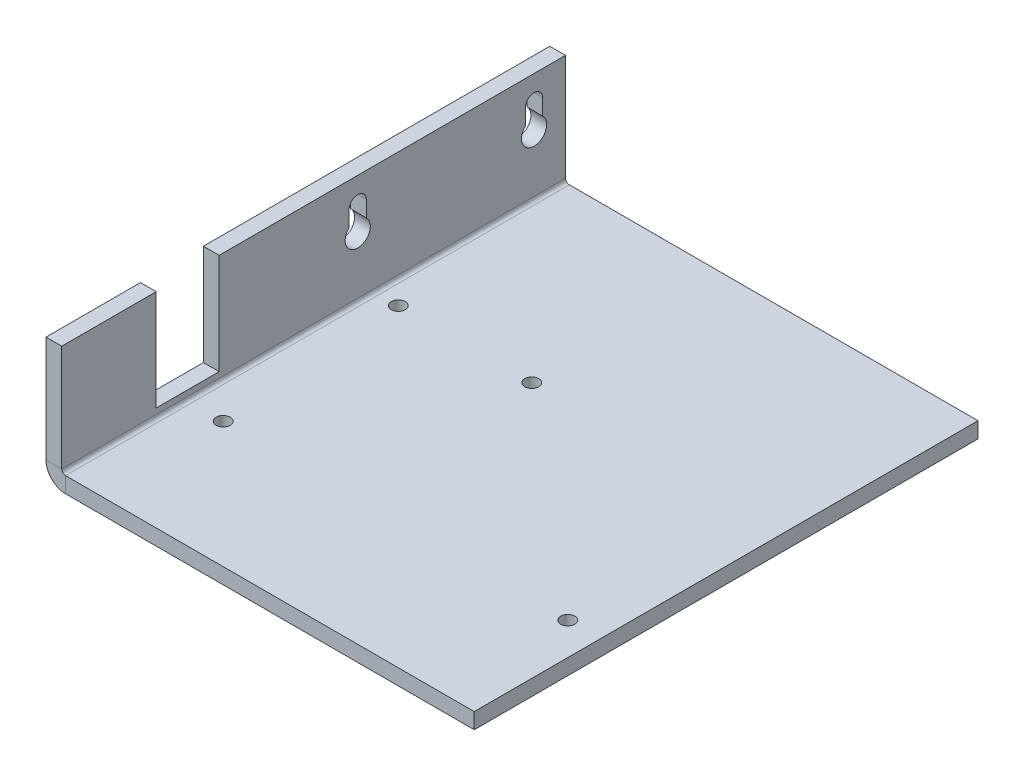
ISO-10303-21;
HEADER;
FILE_DESCRIPTION(('STEP AP214'),'2;1');
FILE_NAME('part.step','',(''),(''),'','','');
FILE_SCHEMA(('AUTOMOTIVE_DESIGN { 1 0 10303 214 1 1 1 1 }'));
ENDSEC;
DATA;
#1=APPLICATION_CONTEXT('core data for automotive mechanical design processes');
#2=APPLICATION_PROTOCOL_DEFINITION('international standard','automotive_design',2000,#1);
#3=PRODUCT_CONTEXT('',#1,'mechanical');
#4=PRODUCT('Part','Part','',(#3));
#5=PRODUCT_RELATED_PRODUCT_CATEGORY('part','',(#4));
#6=PRODUCT_DEFINITION_FORMATION('','',#4);
#7=PRODUCT_DEFINITION_CONTEXT('part definition',#1,'design');
#8=PRODUCT_DEFINITION('design','',#6,#7);
#9=PRODUCT_DEFINITION_SHAPE('','',#8);
#10=(LENGTH_UNIT() NAMED_UNIT(*) SI_UNIT(.MILLI.,.METRE.));
#11=(NAMED_UNIT(*) PLANE_ANGLE_UNIT() SI_UNIT($,.RADIAN.));
#12=(NAMED_UNIT(*) SI_UNIT($,.STERADIAN.) SOLID_ANGLE_UNIT());
#13=UNCERTAINTY_MEASURE_WITH_UNIT(LENGTH_MEASURE(1.E-05),#10,'distance_accuracy_value','');
#14=(GEOMETRIC_REPRESENTATION_CONTEXT(3) GLOBAL_UNCERTAINTY_ASSIGNED_CONTEXT((#13)) GLOBAL_UNIT_ASSIGNED_CONTEXT((#10,
#11,#12)) REPRESENTATION_CONTEXT('',''));
#15=CARTESIAN_POINT('',(0.,0.,0.));
#16=DIRECTION('',(0.,0.,1.));
#17=DIRECTION('',(1.,0.,0.));
#18=AXIS2_PLACEMENT_3D('',#15,#16,#17);
#19=CARTESIAN_POINT('',(167.679572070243,25.4,-101.6));
#20=DIRECTION('',(0.,-1.,0.));
#21=DIRECTION('',(1.,0.,0.));
#22=AXIS2_PLACEMENT_3D('',#19,#20,#21);
#23=PLANE('',#22);
#24=DIRECTION('',(0.,0.,1.));
#25=VECTOR('',#24,1.);
#26=CARTESIAN_POINT('',(-43.18,25.4,-101.6));
#27=LINE('',#26,#25);
#28=CARTESIAN_POINT('',(-43.1799999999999,25.4,-101.6));
#29=VERTEX_POINT('',#28);
#30=CARTESIAN_POINT('',(-43.18,25.4,-31.7500000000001));
#31=VERTEX_POINT('',#30);
#32=EDGE_CURVE('E334',#29,#31,#27,.T.);
#33=ORIENTED_EDGE('',*,*,#32,.T.);
#34=DIRECTION('',(1.,0.,0.));
#35=VECTOR('',#34,1.);
#36=CARTESIAN_POINT('',(167.679572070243,25.4,-31.7500000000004));
#37=LINE('',#36,#35);
#38=CARTESIAN_POINT('',(-40.005,25.4,-31.7500000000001));
#39=VERTEX_POINT('',#38);
#40=EDGE_CURVE('E11',#31,#39,#37,.T.);
#41=ORIENTED_EDGE('',*,*,#40,.T.);
#42=DIRECTION('',(0.,0.,1.));
#43=VECTOR('',#42,1.);
#44=CARTESIAN_POINT('',(-40.005,25.4,-101.6));
#45=LINE('',#44,#43);
#46=CARTESIAN_POINT('',(-40.005,25.4,-101.6));
#47=VERTEX_POINT('',#46);
#48=EDGE_CURVE('E347',#47,#39,#45,.T.);
#49=ORIENTED_EDGE('',*,*,#48,.F.);
#50=DIRECTION('',(-1.,0.,0.));
#51=VECTOR('',#50,1.);
#52=CARTESIAN_POINT('',(167.679572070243,25.4,-101.6));
#53=LINE('',#52,#51);
#54=EDGE_CURVE('E358',#47,#29,#53,.T.);
#55=ORIENTED_EDGE('',*,*,#54,.T.);
#56=EDGE_LOOP('',(#33,#41,#49,#55));
#57=FACE_BOUND('',#56,.T.);
#58=ADVANCED_FACE('F34',(#57),#23,.F.);
#59=CARTESIAN_POINT('',(-40.005,0.,-101.6));
#60=DIRECTION('',(-1.,0.,0.));
#61=DIRECTION('',(0.,0.,1.));
#62=AXIS2_PLACEMENT_3D('',#59,#60,#61);
#63=PLANE('',#62);
#64=ORIENTED_EDGE('',*,*,#48,.T.);
#65=DIRECTION('',(0.,-1.,0.));
#66=VECTOR('',#65,1.);
#67=CARTESIAN_POINT('',(-40.005,0.,-31.7500000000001));
#68=LINE('',#67,#66);
#69=CARTESIAN_POINT('',(-40.005,5.07999999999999,-31.7499999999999));
#70=VERTEX_POINT('',#69);
#71=EDGE_CURVE('E200',#39,#70,#68,.T.);
#72=ORIENTED_EDGE('',*,*,#71,.T.);
#73=DIRECTION('',(0.,0.,1.));
#74=VECTOR('',#73,1.);
#75=CARTESIAN_POINT('',(-40.005,5.08000000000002,-101.6));
#76=LINE('',#75,#74);
#77=CARTESIAN_POINT('',(-40.005,5.08000000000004,-19.05));
#78=VERTEX_POINT('',#77);
#79=EDGE_CURVE('E178',#70,#78,#76,.T.);
#80=ORIENTED_EDGE('',*,*,#79,.T.);
#81=DIRECTION('',(0.,1.,0.));
#82=VECTOR('',#81,1.);
#83=CARTESIAN_POINT('',(-40.005,0.,-19.05));
#84=LINE('',#83,#82);
#85=CARTESIAN_POINT('',(-40.005,25.4,-19.05));
#86=VERTEX_POINT('',#85);
#87=EDGE_CURVE('E196',#78,#86,#84,.T.);
#88=ORIENTED_EDGE('',*,*,#87,.T.);
#89=CARTESIAN_POINT('',(-40.005,25.4,0.));
#90=VERTEX_POINT('',#89);
#91=EDGE_CURVE('E346',#86,#90,#45,.T.);
#92=ORIENTED_EDGE('',*,*,#91,.T.);
#93=DIRECTION('',(0.,1.,0.));
#94=VECTOR('',#93,1.);
#95=CARTESIAN_POINT('',(-40.005,0.,0.));
#96=LINE('',#95,#94);
#97=CARTESIAN_POINT('',(-40.005,3.937,0.));
#98=VERTEX_POINT('',#97);
#99=EDGE_CURVE('E341',#90,#98,#96,.F.);
#100=ORIENTED_EDGE('',*,*,#99,.T.);
#101=DIRECTION('',(0.,0.,-1.));
#102=VECTOR('',#101,1.);
#103=CARTESIAN_POINT('',(-40.005,3.937,-101.6));
#104=LINE('',#103,#102);
#105=CARTESIAN_POINT('',(-40.005,3.93699999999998,-101.6));
#106=VERTEX_POINT('',#105);
#107=EDGE_CURVE('E350',#98,#106,#104,.T.);
#108=ORIENTED_EDGE('',*,*,#107,.T.);
#109=DIRECTION('',(0.,1.,0.));
#110=VECTOR('',#109,1.);
#111=CARTESIAN_POINT('',(-40.005,0.,-101.6));
#112=LINE('',#111,#110);
#113=EDGE_CURVE('E343',#47,#106,#112,.F.);
#114=ORIENTED_EDGE('',*,*,#113,.F.);
#115=EDGE_LOOP('',(#64,#72,#80,#88,#92,#100,#108,#114));
#116=FACE_BOUND('',#115,.T.);
#117=CARTESIAN_POINT('',(-40.005,15.24,-95.2500000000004));
#118=DIRECTION('',(1.,0.,0.));
#119=DIRECTION('',(0.,0.,-1.));
#120=AXIS2_PLACEMENT_3D('',#117,#118,#119);
#121=CIRCLE('',#120,2.54);
#122=CARTESIAN_POINT('',(-40.005,17.1023587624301,-93.5228000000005));
#123=VERTEX_POINT('',#122);
#124=CARTESIAN_POINT('',(-40.005,17.1023587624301,-96.9772000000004));
#125=VERTEX_POINT('',#124);
#126=EDGE_CURVE('E237',#123,#125,#121,.T.);
#127=ORIENTED_EDGE('',*,*,#126,.F.);
#128=DIRECTION('',(0.,-1.,0.));
#129=VECTOR('',#128,1.);
#130=CARTESIAN_POINT('',(-40.005,20.32,-93.5228));
#131=LINE('',#130,#129);
#132=CARTESIAN_POINT('',(-40.005,20.32,-93.5228));
#133=VERTEX_POINT('',#132);
#134=EDGE_CURVE('E235',#133,#123,#131,.T.);
#135=ORIENTED_EDGE('',*,*,#134,.F.);
#136=CARTESIAN_POINT('',(-40.005,20.32,-95.2500000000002));
#137=DIRECTION('',(1.,0.,0.));
#138=DIRECTION('',(0.,0.,-1.));
#139=AXIS2_PLACEMENT_3D('',#136,#137,#138);
#140=CIRCLE('',#139,1.7272);
#141=CARTESIAN_POINT('',(-40.005,20.32,-96.9772000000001));
#142=VERTEX_POINT('',#141);
#143=EDGE_CURVE('E231',#142,#133,#140,.T.);
#144=ORIENTED_EDGE('',*,*,#143,.F.);
#145=DIRECTION('',(0.,1.,0.));
#146=VECTOR('',#145,1.);
#147=CARTESIAN_POINT('',(-40.005,20.32,-96.9772000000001));
#148=LINE('',#147,#146);
#149=EDGE_CURVE('E239',#125,#142,#148,.T.);
#150=ORIENTED_EDGE('',*,*,#149,.F.);
#151=EDGE_LOOP('',(#127,#135,#144,#150));
#152=FACE_BOUND('',#151,.T.);
#153=CARTESIAN_POINT('',(-40.005,20.32,-59.6900000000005));
#154=DIRECTION('',(1.,0.,0.));
#155=DIRECTION('',(0.,0.,1.));
#156=AXIS2_PLACEMENT_3D('',#153,#154,#155);
#157=CIRCLE('',#156,1.7272);
#158=CARTESIAN_POINT('',(-40.005,20.32,-61.4172000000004));
#159=VERTEX_POINT('',#158);
#160=CARTESIAN_POINT('',(-40.005,20.32,-57.9628000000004));
#161=VERTEX_POINT('',#160);
#162=EDGE_CURVE('E207',#159,#161,#157,.T.);
#163=ORIENTED_EDGE('',*,*,#162,.F.);
#164=DIRECTION('',(0.,1.,0.));
#165=VECTOR('',#164,1.);
#166=CARTESIAN_POINT('',(-40.005,20.32,-61.4172000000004));
#167=LINE('',#166,#165);
#168=CARTESIAN_POINT('',(-40.005,17.1023587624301,-61.4172000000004));
#169=VERTEX_POINT('',#168);
#170=EDGE_CURVE('E205',#169,#159,#167,.T.);
#171=ORIENTED_EDGE('',*,*,#170,.F.);
#172=CARTESIAN_POINT('',(-40.005,15.24,-59.6900000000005));
#173=DIRECTION('',(1.,0.,0.));
#174=DIRECTION('',(0.,0.,1.));
#175=AXIS2_PLACEMENT_3D('',#172,#173,#174);
#176=CIRCLE('',#175,2.54);
#177=CARTESIAN_POINT('',(-40.005,17.1023587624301,-57.9628000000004));
#178=VERTEX_POINT('',#177);
#179=EDGE_CURVE('E203',#178,#169,#176,.T.);
#180=ORIENTED_EDGE('',*,*,#179,.F.);
#181=DIRECTION('',(0.,-1.,0.));
#182=VECTOR('',#181,1.);
#183=CARTESIAN_POINT('',(-40.005,20.32,-57.9628000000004));
#184=LINE('',#183,#182);
#185=EDGE_CURVE('E209',#161,#178,#184,.T.);
#186=ORIENTED_EDGE('',*,*,#185,.F.);
#187=EDGE_LOOP('',(#163,#171,#180,#186));
#188=FACE_BOUND('',#187,.T.);
#189=ADVANCED_FACE('F375',(#116,#152,#188),#63,.F.);
#190=CARTESIAN_POINT('',(-43.18,0.,-101.6));
#191=DIRECTION('',(-1.,0.,0.));
#192=DIRECTION('',(0.,0.,1.));
#193=AXIS2_PLACEMENT_3D('',#190,#191,#192);
#194=PLANE('',#193);
#195=DIRECTION('',(0.,-1.,0.));
#196=VECTOR('',#195,1.);
#197=CARTESIAN_POINT('',(-43.18,45.72,-31.7499999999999));
#198=LINE('',#197,#196);
#199=CARTESIAN_POINT('',(-43.18,5.08,-31.7499999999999));
#200=VERTEX_POINT('',#199);
#201=EDGE_CURVE('E184',#31,#200,#198,.T.);
#202=ORIENTED_EDGE('',*,*,#201,.F.);
#203=ORIENTED_EDGE('',*,*,#32,.F.);
#204=DIRECTION('',(0.,-1.,0.));
#205=VECTOR('',#204,1.);
#206=CARTESIAN_POINT('',(-43.18,0.,-101.6));
#207=LINE('',#206,#205);
#208=CARTESIAN_POINT('',(-43.18,3.93700000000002,-101.6));
#209=VERTEX_POINT('',#208);
#210=EDGE_CURVE('E336',#29,#209,#207,.T.);
#211=ORIENTED_EDGE('',*,*,#210,.T.);
#212=DIRECTION('',(0.,0.,-1.));
#213=VECTOR('',#212,1.);
#214=CARTESIAN_POINT('',(-43.18,3.93700000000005,-101.6));
#215=LINE('',#214,#213);
#216=CARTESIAN_POINT('',(-43.18,3.93700000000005,0.));
#217=VERTEX_POINT('',#216);
#218=EDGE_CURVE('E338',#217,#209,#215,.T.);
#219=ORIENTED_EDGE('',*,*,#218,.F.);
#220=DIRECTION('',(0.,-1.,0.));
#221=VECTOR('',#220,1.);
#222=CARTESIAN_POINT('',(-43.18,0.,0.));
#223=LINE('',#222,#221);
#224=CARTESIAN_POINT('',(-43.18,25.4,0.));
#225=VERTEX_POINT('',#224);
#226=EDGE_CURVE('E279',#225,#217,#223,.T.);
#227=ORIENTED_EDGE('',*,*,#226,.F.);
#228=CARTESIAN_POINT('',(-43.18,25.4,-19.05));
#229=VERTEX_POINT('',#228);
#230=EDGE_CURVE('E333',#229,#225,#27,.T.);
#231=ORIENTED_EDGE('',*,*,#230,.F.);
#232=DIRECTION('',(0.,1.,0.));
#233=VECTOR('',#232,1.);
#234=CARTESIAN_POINT('',(-43.18,45.72,-19.05));
#235=LINE('',#234,#233);
#236=CARTESIAN_POINT('',(-43.18,5.07999999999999,-19.05));
#237=VERTEX_POINT('',#236);
#238=EDGE_CURVE('E49',#237,#229,#235,.T.);
#239=ORIENTED_EDGE('',*,*,#238,.F.);
#240=DIRECTION('',(0.,0.,1.));
#241=VECTOR('',#240,1.);
#242=CARTESIAN_POINT('',(-43.18,5.08,-31.7499999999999));
#243=LINE('',#242,#241);
#244=EDGE_CURVE('E176',#200,#237,#243,.T.);
#245=ORIENTED_EDGE('',*,*,#244,.F.);
#246=EDGE_LOOP('',(#202,#203,#211,#219,#227,#231,#239,#245));
#247=FACE_BOUND('',#246,.T.);
#248=DIRECTION('',(0.,1.,0.));
#249=VECTOR('',#248,1.);
#250=CARTESIAN_POINT('',(-43.18,0.,-93.5228));
#251=LINE('',#250,#249);
#252=CARTESIAN_POINT('',(-43.18,20.32,-93.5228));
#253=VERTEX_POINT('',#252);
#254=CARTESIAN_POINT('',(-43.18,17.1023587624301,-93.5228000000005));
#255=VERTEX_POINT('',#254);
#256=EDGE_CURVE('E244',#253,#255,#251,.F.);
#257=ORIENTED_EDGE('',*,*,#256,.T.);
#258=CARTESIAN_POINT('',(-43.18,15.24,-95.2500000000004));
#259=DIRECTION('',(1.,0.,0.));
#260=DIRECTION('',(0.,0.,-1.));
#261=AXIS2_PLACEMENT_3D('',#258,#259,#260);
#262=CIRCLE('',#261,2.54);
#263=CARTESIAN_POINT('',(-43.18,17.1023587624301,-96.9772000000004));
#264=VERTEX_POINT('',#263);
#265=EDGE_CURVE('E249',#255,#264,#262,.T.);
#266=ORIENTED_EDGE('',*,*,#265,.T.);
#267=DIRECTION('',(0.,1.,0.));
#268=VECTOR('',#267,1.);
#269=CARTESIAN_POINT('',(-43.18,0.,-96.9772));
#270=LINE('',#269,#268);
#271=CARTESIAN_POINT('',(-43.18,20.32,-96.9772000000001));
#272=VERTEX_POINT('',#271);
#273=EDGE_CURVE('E245',#264,#272,#270,.T.);
#274=ORIENTED_EDGE('',*,*,#273,.T.);
#275=CARTESIAN_POINT('',(-43.18,20.32,-95.2500000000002));
#276=DIRECTION('',(1.,0.,0.));
#277=DIRECTION('',(0.,0.,-1.));
#278=AXIS2_PLACEMENT_3D('',#275,#276,#277);
#279=CIRCLE('',#278,1.7272);
#280=EDGE_CURVE('E241',#272,#253,#279,.T.);
#281=ORIENTED_EDGE('',*,*,#280,.T.);
#282=EDGE_LOOP('',(#257,#266,#274,#281));
#283=FACE_BOUND('',#282,.T.);
#284=DIRECTION('',(0.,1.,0.));
#285=VECTOR('',#284,1.);
#286=CARTESIAN_POINT('',(-43.18,0.,-61.4172000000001));
#287=LINE('',#286,#285);
#288=CARTESIAN_POINT('',(-43.18,17.1023587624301,-61.4172000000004));
#289=VERTEX_POINT('',#288);
#290=CARTESIAN_POINT('',(-43.18,20.32,-61.4172000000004));
#291=VERTEX_POINT('',#290);
#292=EDGE_CURVE('E214',#289,#291,#287,.T.);
#293=ORIENTED_EDGE('',*,*,#292,.T.);
#294=CARTESIAN_POINT('',(-43.18,20.32,-59.6900000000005));
#295=DIRECTION('',(1.,0.,0.));
#296=DIRECTION('',(0.,0.,-1.));
#297=AXIS2_PLACEMENT_3D('',#294,#295,#296);
#298=CIRCLE('',#297,1.7272);
#299=CARTESIAN_POINT('',(-43.18,20.32,-57.9628000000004));
#300=VERTEX_POINT('',#299);
#301=EDGE_CURVE('E218',#291,#300,#298,.T.);
#302=ORIENTED_EDGE('',*,*,#301,.T.);
#303=DIRECTION('',(0.,1.,0.));
#304=VECTOR('',#303,1.);
#305=CARTESIAN_POINT('',(-43.18,0.,-57.9628000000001));
#306=LINE('',#305,#304);
#307=CARTESIAN_POINT('',(-43.18,17.1023587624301,-57.9628000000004));
#308=VERTEX_POINT('',#307);
#309=EDGE_CURVE('E215',#300,#308,#306,.F.);
#310=ORIENTED_EDGE('',*,*,#309,.T.);
#311=CARTESIAN_POINT('',(-43.18,15.24,-59.6900000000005));
#312=DIRECTION('',(1.,0.,0.));
#313=DIRECTION('',(0.,0.,-1.));
#314=AXIS2_PLACEMENT_3D('',#311,#312,#313);
#315=CIRCLE('',#314,2.54);
#316=EDGE_CURVE('E211',#308,#289,#315,.T.);
#317=ORIENTED_EDGE('',*,*,#316,.T.);
#318=EDGE_LOOP('',(#293,#302,#310,#317));
#319=FACE_BOUND('',#318,.T.);
#320=ADVANCED_FACE('F190',(#247,#283,#319),#194,.T.);
#321=CARTESIAN_POINT('',(167.679572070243,0.,-101.6));
#322=DIRECTION('',(0.,0.,-1.));
#323=DIRECTION('',(0.,1.,0.));
#324=AXIS2_PLACEMENT_3D('',#321,#322,#323);
#325=PLANE('',#324);
#326=DIRECTION('',(-1.,0.,0.));
#327=VECTOR('',#326,1.);
#328=CARTESIAN_POINT('',(167.679572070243,3.93700000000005,-101.6));
#329=LINE('',#328,#327);
#330=EDGE_CURVE('E361',#106,#209,#329,.T.);
#331=ORIENTED_EDGE('',*,*,#330,.T.);
#332=ORIENTED_EDGE('',*,*,#210,.F.);
#333=ORIENTED_EDGE('',*,*,#54,.F.);
#334=ORIENTED_EDGE('',*,*,#113,.T.);
#335=EDGE_LOOP('',(#331,#332,#333,#334));
#336=FACE_BOUND('',#335,.T.);
#337=ADVANCED_FACE('F36',(#336),#325,.T.);
#338=ORIENTED_EDGE('',*,*,#91,.F.);
#339=DIRECTION('',(-1.,0.,0.));
#340=VECTOR('',#339,1.);
#341=CARTESIAN_POINT('',(167.679572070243,25.4,-19.0500000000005));
#342=LINE('',#341,#340);
#343=EDGE_CURVE('E42',#86,#229,#342,.T.);
#344=ORIENTED_EDGE('',*,*,#343,.T.);
#345=ORIENTED_EDGE('',*,*,#230,.T.);
#346=DIRECTION('',(-1.,0.,0.));
#347=VECTOR('',#346,1.);
#348=CARTESIAN_POINT('',(167.679572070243,25.4,-4.44089209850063E-13));
#349=LINE('',#348,#347);
#350=EDGE_CURVE('E355',#90,#225,#349,.T.);
#351=ORIENTED_EDGE('',*,*,#350,.F.);
#352=EDGE_LOOP('',(#338,#344,#345,#351));
#353=FACE_BOUND('',#352,.T.);
#354=ADVANCED_FACE('F365',(#353),#23,.F.);
#355=CARTESIAN_POINT('',(167.679572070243,0.,0.));
#356=DIRECTION('',(0.,0.,-1.));
#357=DIRECTION('',(0.,1.,0.));
#358=AXIS2_PLACEMENT_3D('',#355,#356,#357);
#359=PLANE('',#358);
#360=ORIENTED_EDGE('',*,*,#226,.T.);
#361=DIRECTION('',(-1.,0.,0.));
#362=VECTOR('',#361,1.);
#363=CARTESIAN_POINT('',(167.679572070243,3.93700000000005,0.));
#364=LINE('',#363,#362);
#365=EDGE_CURVE('E352',#98,#217,#364,.T.);
#366=ORIENTED_EDGE('',*,*,#365,.F.);
#367=ORIENTED_EDGE('',*,*,#99,.F.);
#368=ORIENTED_EDGE('',*,*,#350,.T.);
#369=EDGE_LOOP('',(#360,#366,#367,#368));
#370=FACE_BOUND('',#369,.T.);
#371=ADVANCED_FACE('F371',(#370),#359,.F.);
#372=CARTESIAN_POINT('',(43.18,264.832110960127,-101.6));
#373=DIRECTION('',(1.,0.,0.));
#374=DIRECTION('',(0.,0.,-1.));
#375=AXIS2_PLACEMENT_3D('',#372,#373,#374);
#376=PLANE('',#375);
#377=DIRECTION('',(0.,-1.,0.));
#378=VECTOR('',#377,1.);
#379=CARTESIAN_POINT('',(43.18,264.832110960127,0.));
#380=LINE('',#379,#378);
#381=CARTESIAN_POINT('',(43.18,3.17499999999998,0.));
#382=VERTEX_POINT('',#381);
#383=CARTESIAN_POINT('',(43.18,0.,0.));
#384=VERTEX_POINT('',#383);
#385=EDGE_CURVE('E325',#382,#384,#380,.T.);
#386=ORIENTED_EDGE('',*,*,#385,.T.);
#387=DIRECTION('',(0.,0.,1.));
#388=VECTOR('',#387,1.);
#389=CARTESIAN_POINT('',(43.18,0.,-101.6));
#390=LINE('',#389,#388);
#391=CARTESIAN_POINT('',(43.18,0.,-101.6));
#392=VERTEX_POINT('',#391);
#393=EDGE_CURVE('E283',#392,#384,#390,.T.);
#394=ORIENTED_EDGE('',*,*,#393,.F.);
#395=DIRECTION('',(0.,-1.,0.));
#396=VECTOR('',#395,1.);
#397=CARTESIAN_POINT('',(43.18,264.832110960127,-101.6));
#398=LINE('',#397,#396);
#399=CARTESIAN_POINT('',(43.18,3.17500000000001,-101.6));
#400=VERTEX_POINT('',#399);
#401=EDGE_CURVE('E280',#400,#392,#398,.T.);
#402=ORIENTED_EDGE('',*,*,#401,.F.);
#403=DIRECTION('',(0.,0.,1.));
#404=VECTOR('',#403,1.);
#405=CARTESIAN_POINT('',(43.18,3.17500000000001,-101.6));
#406=LINE('',#405,#404);
#407=EDGE_CURVE('E323',#400,#382,#406,.T.);
#408=ORIENTED_EDGE('',*,*,#407,.T.);
#409=EDGE_LOOP('',(#386,#394,#402,#408));
#410=FACE_BOUND('',#409,.T.);
#411=ADVANCED_FACE('F397',(#410),#376,.T.);
#412=CARTESIAN_POINT('',(36.6522,3.17500000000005,-25.4));
#413=DIRECTION('',(0.,1.,0.));
#414=DIRECTION('',(0.,0.,1.));
#415=AXIS2_PLACEMENT_3D('',#412,#413,#414);
#416=CYLINDRICAL_SURFACE('',#415,1.4224);
#417=CARTESIAN_POINT('',(36.6522,0.,-25.4));
#418=DIRECTION('',(0.,-1.,0.));
#419=DIRECTION('',(0.,0.,-1.));
#420=AXIS2_PLACEMENT_3D('',#417,#418,#419);
#421=CIRCLE('',#420,1.4224);
#422=CARTESIAN_POINT('',(36.6522,0.,-26.8224));
#423=VERTEX_POINT('',#422);
#424=EDGE_CURVE('E320',#423,#423,#421,.T.);
#425=ORIENTED_EDGE('',*,*,#424,.T.);
#426=EDGE_LOOP('',(#425));
#427=FACE_BOUND('',#426,.T.);
#428=CARTESIAN_POINT('',(36.6522,3.17500000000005,-25.4));
#429=DIRECTION('',(0.,1.,0.));
#430=DIRECTION('',(0.,0.,1.));
#431=AXIS2_PLACEMENT_3D('',#428,#429,#430);
#432=CIRCLE('',#431,1.4224);
#433=CARTESIAN_POINT('',(36.6522,3.17500000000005,-23.9776));
#434=VERTEX_POINT('',#433);
#435=EDGE_CURVE('E317',#434,#434,#432,.T.);
#436=ORIENTED_EDGE('',*,*,#435,.T.);
#437=EDGE_LOOP('',(#436));
#438=FACE_BOUND('',#437,.T.);
#439=ADVANCED_FACE('F456',(#427,#438),#416,.F.);
#440=CARTESIAN_POINT('',(-32.8422,3.17500000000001,-25.4));
#441=DIRECTION('',(0.,1.,0.));
#442=DIRECTION('',(0.,0.,1.));
#443=AXIS2_PLACEMENT_3D('',#440,#441,#442);
#444=CYLINDRICAL_SURFACE('',#443,1.4224);
#445=CARTESIAN_POINT('',(-32.8422,0.,-25.4));
#446=DIRECTION('',(0.,-1.,0.));
#447=DIRECTION('',(0.,0.,-1.));
#448=AXIS2_PLACEMENT_3D('',#445,#446,#447);
#449=CIRCLE('',#448,1.4224);
#450=CARTESIAN_POINT('',(-32.8422,0.,-26.8224));
#451=VERTEX_POINT('',#450);
#452=EDGE_CURVE('E314',#451,#451,#449,.T.);
#453=ORIENTED_EDGE('',*,*,#452,.T.);
#454=EDGE_LOOP('',(#453));
#455=FACE_BOUND('',#454,.T.);
#456=CARTESIAN_POINT('',(-32.8422,3.17500000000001,-25.4));
#457=DIRECTION('',(0.,1.,0.));
#458=DIRECTION('',(0.,0.,1.));
#459=AXIS2_PLACEMENT_3D('',#456,#457,#458);
#460=CIRCLE('',#459,1.4224);
#461=CARTESIAN_POINT('',(-32.8422,3.17500000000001,-23.9776));
#462=VERTEX_POINT('',#461);
#463=EDGE_CURVE('E311',#462,#462,#460,.T.);
#464=ORIENTED_EDGE('',*,*,#463,.T.);
#465=EDGE_LOOP('',(#464));
#466=FACE_BOUND('',#465,.T.);
#467=ADVANCED_FACE('F459',(#455,#466),#444,.F.);
#468=CARTESIAN_POINT('',(-8.4582,3.17500000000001,-63.246));
#469=DIRECTION('',(0.,1.,0.));
#470=DIRECTION('',(0.,0.,1.));
#471=AXIS2_PLACEMENT_3D('',#468,#469,#470);
#472=CYLINDRICAL_SURFACE('',#471,1.42239999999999);
#473=CARTESIAN_POINT('',(-8.4582,0.,-63.246));
#474=DIRECTION('',(0.,-1.,0.));
#475=DIRECTION('',(0.,0.,-1.));
#476=AXIS2_PLACEMENT_3D('',#473,#474,#475);
#477=CIRCLE('',#476,1.42239999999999);
#478=CARTESIAN_POINT('',(-8.4582,0.,-64.6684));
#479=VERTEX_POINT('',#478);
#480=EDGE_CURVE('E308',#479,#479,#477,.T.);
#481=ORIENTED_EDGE('',*,*,#480,.T.);
#482=EDGE_LOOP('',(#481));
#483=FACE_BOUND('',#482,.T.);
#484=CARTESIAN_POINT('',(-8.4582,3.17500000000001,-63.246));
#485=DIRECTION('',(0.,1.,0.));
#486=DIRECTION('',(0.,0.,1.));
#487=AXIS2_PLACEMENT_3D('',#484,#485,#486);
#488=CIRCLE('',#487,1.42239999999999);
#489=CARTESIAN_POINT('',(-8.4582,3.17500000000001,-61.8236));
#490=VERTEX_POINT('',#489);
#491=EDGE_CURVE('E305',#490,#490,#488,.T.);
#492=ORIENTED_EDGE('',*,*,#491,.T.);
#493=EDGE_LOOP('',(#492));
#494=FACE_BOUND('',#493,.T.);
#495=ADVANCED_FACE('F463',(#483,#494),#472,.F.);
#496=CARTESIAN_POINT('',(-35.3822,3.17500000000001,-63.246));
#497=DIRECTION('',(0.,1.,0.));
#498=DIRECTION('',(0.,0.,1.));
#499=AXIS2_PLACEMENT_3D('',#496,#497,#498);
#500=CYLINDRICAL_SURFACE('',#499,1.42239999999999);
#501=CARTESIAN_POINT('',(-35.3822,0.,-63.246));
#502=DIRECTION('',(0.,-1.,0.));
#503=DIRECTION('',(0.,0.,-1.));
#504=AXIS2_PLACEMENT_3D('',#501,#502,#503);
#505=CIRCLE('',#504,1.42239999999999);
#506=CARTESIAN_POINT('',(-35.3822,0.,-64.6684));
#507=VERTEX_POINT('',#506);
#508=EDGE_CURVE('E302',#507,#507,#505,.T.);
#509=ORIENTED_EDGE('',*,*,#508,.T.);
#510=EDGE_LOOP('',(#509));
#511=FACE_BOUND('',#510,.T.);
#512=CARTESIAN_POINT('',(-35.3822,3.17500000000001,-63.246));
#513=DIRECTION('',(0.,1.,0.));
#514=DIRECTION('',(0.,0.,1.));
#515=AXIS2_PLACEMENT_3D('',#512,#513,#514);
#516=CIRCLE('',#515,1.42239999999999);
#517=CARTESIAN_POINT('',(-35.3822,3.17500000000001,-61.8236));
#518=VERTEX_POINT('',#517);
#519=EDGE_CURVE('E299',#518,#518,#516,.T.);
#520=ORIENTED_EDGE('',*,*,#519,.T.);
#521=EDGE_LOOP('',(#520));
#522=FACE_BOUND('',#521,.T.);
#523=ADVANCED_FACE('F467',(#511,#522),#500,.F.);
#524=CARTESIAN_POINT('',(-43.18,3.17500000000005,-101.6));
#525=DIRECTION('',(0.,-1.,0.));
#526=DIRECTION('',(0.,0.,-1.));
#527=AXIS2_PLACEMENT_3D('',#524,#525,#526);
#528=PLANE('',#527);
#529=ORIENTED_EDGE('',*,*,#519,.F.);
#530=EDGE_LOOP('',(#529));
#531=FACE_BOUND('',#530,.T.);
#532=ORIENTED_EDGE('',*,*,#491,.F.);
#533=EDGE_LOOP('',(#532));
#534=FACE_BOUND('',#533,.T.);
#535=ORIENTED_EDGE('',*,*,#463,.F.);
#536=EDGE_LOOP('',(#535));
#537=FACE_BOUND('',#536,.T.);
#538=ORIENTED_EDGE('',*,*,#435,.F.);
#539=EDGE_LOOP('',(#538));
#540=FACE_BOUND('',#539,.T.);
#541=DIRECTION('',(0.,0.,-1.));
#542=VECTOR('',#541,1.);
#543=CARTESIAN_POINT('',(-39.243,3.17499999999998,-101.6));
#544=LINE('',#543,#542);
#545=CARTESIAN_POINT('',(-39.243,3.175,0.));
#546=VERTEX_POINT('',#545);
#547=CARTESIAN_POINT('',(-39.243,3.175,-101.6));
#548=VERTEX_POINT('',#547);
#549=EDGE_CURVE('E275',#546,#548,#544,.T.);
#550=ORIENTED_EDGE('',*,*,#549,.F.);
#551=DIRECTION('',(1.,0.,0.));
#552=VECTOR('',#551,1.);
#553=CARTESIAN_POINT('',(-43.18,3.17500000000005,0.));
#554=LINE('',#553,#552);
#555=EDGE_CURVE('E296',#546,#382,#554,.T.);
#556=ORIENTED_EDGE('',*,*,#555,.T.);
#557=ORIENTED_EDGE('',*,*,#407,.F.);
#558=DIRECTION('',(1.,0.,0.));
#559=VECTOR('',#558,1.);
#560=CARTESIAN_POINT('',(-43.18,3.17500000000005,-101.6));
#561=LINE('',#560,#559);
#562=EDGE_CURVE('E276',#548,#400,#561,.T.);
#563=ORIENTED_EDGE('',*,*,#562,.F.);
#564=EDGE_LOOP('',(#550,#556,#557,#563));
#565=FACE_BOUND('',#564,.T.);
#566=ADVANCED_FACE('F420',(#531,#534,#537,#540,#565),#528,.F.);
#567=CARTESIAN_POINT('',(-43.18,264.832110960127,0.));
#568=DIRECTION('',(0.,0.,-1.));
#569=DIRECTION('',(-1.,0.,0.));
#570=AXIS2_PLACEMENT_3D('',#567,#568,#569);
#571=PLANE('',#570);
#572=DIRECTION('',(1.,0.,0.));
#573=VECTOR('',#572,1.);
#574=CARTESIAN_POINT('',(-43.18,0.,0.));
#575=LINE('',#574,#573);
#576=CARTESIAN_POINT('',(-39.243,0.,0.));
#577=VERTEX_POINT('',#576);
#578=EDGE_CURVE('E293',#577,#384,#575,.T.);
#579=ORIENTED_EDGE('',*,*,#578,.T.);
#580=ORIENTED_EDGE('',*,*,#385,.F.);
#581=ORIENTED_EDGE('',*,*,#555,.F.);
#582=DIRECTION('',(0.,-1.,0.));
#583=VECTOR('',#582,1.);
#584=CARTESIAN_POINT('',(-39.243,264.832110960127,0.));
#585=LINE('',#584,#583);
#586=EDGE_CURVE('E290',#546,#577,#585,.T.);
#587=ORIENTED_EDGE('',*,*,#586,.T.);
#588=EDGE_LOOP('',(#579,#580,#581,#587));
#589=FACE_BOUND('',#588,.T.);
#590=ADVANCED_FACE('F426',(#589),#571,.F.);
#591=CARTESIAN_POINT('',(-43.18,0.,-101.6));
#592=DIRECTION('',(0.,-1.,0.));
#593=DIRECTION('',(0.,0.,-1.));
#594=AXIS2_PLACEMENT_3D('',#591,#592,#593);
#595=PLANE('',#594);
#596=ORIENTED_EDGE('',*,*,#452,.F.);
#597=EDGE_LOOP('',(#596));
#598=FACE_BOUND('',#597,.T.);
#599=ORIENTED_EDGE('',*,*,#508,.F.);
#600=EDGE_LOOP('',(#599));
#601=FACE_BOUND('',#600,.T.);
#602=ORIENTED_EDGE('',*,*,#480,.F.);
#603=EDGE_LOOP('',(#602));
#604=FACE_BOUND('',#603,.T.);
#605=ORIENTED_EDGE('',*,*,#424,.F.);
#606=EDGE_LOOP('',(#605));
#607=FACE_BOUND('',#606,.T.);
#608=ORIENTED_EDGE('',*,*,#578,.F.);
#609=DIRECTION('',(0.,0.,-1.));
#610=VECTOR('',#609,1.);
#611=CARTESIAN_POINT('',(-39.243,0.,-101.6));
#612=LINE('',#611,#610);
#613=CARTESIAN_POINT('',(-39.243,0.,-101.6));
#614=VERTEX_POINT('',#613);
#615=EDGE_CURVE('E287',#577,#614,#612,.T.);
#616=ORIENTED_EDGE('',*,*,#615,.T.);
#617=DIRECTION('',(1.,0.,0.));
#618=VECTOR('',#617,1.);
#619=CARTESIAN_POINT('',(-43.18,0.,-101.6));
#620=LINE('',#619,#618);
#621=EDGE_CURVE('E285',#614,#392,#620,.T.);
#622=ORIENTED_EDGE('',*,*,#621,.T.);
#623=ORIENTED_EDGE('',*,*,#393,.T.);
#624=EDGE_LOOP('',(#608,#616,#622,#623));
#625=FACE_BOUND('',#624,.T.);
#626=ADVANCED_FACE('F429',(#598,#601,#604,#607,#625),#595,.T.);
#627=CARTESIAN_POINT('',(-43.18,264.832110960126,-101.6));
#628=DIRECTION('',(0.,0.,-1.));
#629=DIRECTION('',(-1.,0.,0.));
#630=AXIS2_PLACEMENT_3D('',#627,#628,#629);
#631=PLANE('',#630);
#632=ORIENTED_EDGE('',*,*,#401,.T.);
#633=ORIENTED_EDGE('',*,*,#621,.F.);
#634=DIRECTION('',(0.,-1.,0.));
#635=VECTOR('',#634,1.);
#636=CARTESIAN_POINT('',(-39.243,264.832110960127,-101.6));
#637=LINE('',#636,#635);
#638=EDGE_CURVE('E328',#548,#614,#637,.T.);
#639=ORIENTED_EDGE('',*,*,#638,.F.);
#640=ORIENTED_EDGE('',*,*,#562,.T.);
#641=EDGE_LOOP('',(#632,#633,#639,#640));
#642=FACE_BOUND('',#641,.T.);
#643=ADVANCED_FACE('F416',(#642),#631,.T.);
#644=CARTESIAN_POINT('',(-39.243,3.93700000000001,-101.6));
#645=DIRECTION('',(0.,0.,-1.));
#646=DIRECTION('',(-1.,0.,0.));
#647=AXIS2_PLACEMENT_3D('',#644,#645,#646);
#648=PLANE('',#647);
#649=ORIENTED_EDGE('',*,*,#330,.F.);
#650=CARTESIAN_POINT('',(-39.243,3.93700000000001,-101.6));
#651=DIRECTION('',(0.,0.,1.));
#652=DIRECTION('',(1.,0.,0.));
#653=AXIS2_PLACEMENT_3D('',#650,#651,#652);
#654=CIRCLE('',#653,0.762000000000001);
#655=EDGE_CURVE('E262',#106,#548,#654,.T.);
#656=ORIENTED_EDGE('',*,*,#655,.T.);
#657=ORIENTED_EDGE('',*,*,#638,.T.);
#658=CARTESIAN_POINT('',(-39.243,3.93700000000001,-101.6));
#659=DIRECTION('',(0.,0.,1.));
#660=DIRECTION('',(1.,0.,0.));
#661=AXIS2_PLACEMENT_3D('',#658,#659,#660);
#662=CIRCLE('',#661,3.937);
#663=EDGE_CURVE('E269',#209,#614,#662,.T.);
#664=ORIENTED_EDGE('',*,*,#663,.F.);
#665=EDGE_LOOP('',(#649,#656,#657,#664));
#666=FACE_BOUND('',#665,.T.);
#667=ADVANCED_FACE('F412',(#666),#648,.T.);
#668=CARTESIAN_POINT('',(-39.243,3.937,0.));
#669=DIRECTION('',(0.,0.,1.));
#670=DIRECTION('',(1.,0.,0.));
#671=AXIS2_PLACEMENT_3D('',#668,#669,#670);
#672=PLANE('',#671);
#673=CARTESIAN_POINT('',(-39.243,3.937,0.));
#674=DIRECTION('',(0.,0.,1.));
#675=DIRECTION('',(1.,0.,0.));
#676=AXIS2_PLACEMENT_3D('',#673,#674,#675);
#677=CIRCLE('',#676,0.762000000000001);
#678=EDGE_CURVE('E266',#546,#98,#677,.F.);
#679=ORIENTED_EDGE('',*,*,#678,.T.);
#680=ORIENTED_EDGE('',*,*,#365,.T.);
#681=CARTESIAN_POINT('',(-39.243,3.937,0.));
#682=DIRECTION('',(0.,0.,1.));
#683=DIRECTION('',(1.,0.,0.));
#684=AXIS2_PLACEMENT_3D('',#681,#682,#683);
#685=CIRCLE('',#684,3.937);
#686=EDGE_CURVE('E272',#577,#217,#685,.F.);
#687=ORIENTED_EDGE('',*,*,#686,.F.);
#688=ORIENTED_EDGE('',*,*,#586,.F.);
#689=EDGE_LOOP('',(#679,#680,#687,#688));
#690=FACE_BOUND('',#689,.T.);
#691=ADVANCED_FACE('F431',(#690),#672,.T.);
#692=CARTESIAN_POINT('',(-39.243,3.937,-249.604602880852));
#693=DIRECTION('',(0.,0.,1.));
#694=DIRECTION('',(1.,0.,0.));
#695=AXIS2_PLACEMENT_3D('',#692,#693,#694);
#696=CYLINDRICAL_SURFACE('',#695,3.937);
#697=ORIENTED_EDGE('',*,*,#615,.F.);
#698=ORIENTED_EDGE('',*,*,#686,.T.);
#699=ORIENTED_EDGE('',*,*,#218,.T.);
#700=ORIENTED_EDGE('',*,*,#663,.T.);
#701=EDGE_LOOP('',(#697,#698,#699,#700));
#702=FACE_BOUND('',#701,.T.);
#703=ADVANCED_FACE('F409',(#702),#696,.T.);
#704=CARTESIAN_POINT('',(-39.243,3.937,-249.604602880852));
#705=DIRECTION('',(0.,0.,1.));
#706=DIRECTION('',(1.,0.,0.));
#707=AXIS2_PLACEMENT_3D('',#704,#705,#706);
#708=CYLINDRICAL_SURFACE('',#707,0.762000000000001);
#709=ORIENTED_EDGE('',*,*,#549,.T.);
#710=ORIENTED_EDGE('',*,*,#655,.F.);
#711=ORIENTED_EDGE('',*,*,#107,.F.);
#712=ORIENTED_EDGE('',*,*,#678,.F.);
#713=EDGE_LOOP('',(#709,#710,#711,#712));
#714=FACE_BOUND('',#713,.T.);
#715=ADVANCED_FACE('F434',(#714),#708,.F.);
#716=CARTESIAN_POINT('',(-40.005,15.24,-95.2500000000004));
#717=DIRECTION('',(1.,0.,0.));
#718=DIRECTION('',(0.,0.,-1.));
#719=AXIS2_PLACEMENT_3D('',#716,#717,#718);
#720=CYLINDRICAL_SURFACE('',#719,2.54);
#721=DIRECTION('',(1.,0.,0.));
#722=VECTOR('',#721,1.);
#723=CARTESIAN_POINT('',(-40.005,17.1023587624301,-93.5228000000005));
#724=LINE('',#723,#722);
#725=EDGE_CURVE('E260',#123,#255,#724,.F.);
#726=ORIENTED_EDGE('',*,*,#725,.F.);
#727=ORIENTED_EDGE('',*,*,#126,.T.);
#728=DIRECTION('',(1.,0.,0.));
#729=VECTOR('',#728,1.);
#730=CARTESIAN_POINT('',(-40.005,17.1023587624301,-96.9772000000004));
#731=LINE('',#730,#729);
#732=EDGE_CURVE('E257',#125,#264,#731,.F.);
#733=ORIENTED_EDGE('',*,*,#732,.T.);
#734=ORIENTED_EDGE('',*,*,#265,.F.);
#735=EDGE_LOOP('',(#726,#727,#733,#734));
#736=FACE_BOUND('',#735,.T.);
#737=ADVANCED_FACE('F436',(#736),#720,.F.);
#738=CARTESIAN_POINT('',(-40.005,20.32,-96.9772000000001));
#739=DIRECTION('',(0.,0.,1.));
#740=DIRECTION('',(0.,1.,0.));
#741=AXIS2_PLACEMENT_3D('',#738,#739,#740);
#742=PLANE('',#741);
#743=ORIENTED_EDGE('',*,*,#732,.F.);
#744=ORIENTED_EDGE('',*,*,#149,.T.);
#745=DIRECTION('',(1.,0.,0.));
#746=VECTOR('',#745,1.);
#747=CARTESIAN_POINT('',(-40.005,20.32,-96.9772000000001));
#748=LINE('',#747,#746);
#749=EDGE_CURVE('E254',#142,#272,#748,.F.);
#750=ORIENTED_EDGE('',*,*,#749,.T.);
#751=ORIENTED_EDGE('',*,*,#273,.F.);
#752=EDGE_LOOP('',(#743,#744,#750,#751));
#753=FACE_BOUND('',#752,.T.);
#754=ADVANCED_FACE('F442',(#753),#742,.T.);
#755=CARTESIAN_POINT('',(-40.005,20.32,-95.2500000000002));
#756=DIRECTION('',(1.,0.,0.));
#757=DIRECTION('',(0.,0.,-1.));
#758=AXIS2_PLACEMENT_3D('',#755,#756,#757);
#759=CYLINDRICAL_SURFACE('',#758,1.7272);
#760=ORIENTED_EDGE('',*,*,#749,.F.);
#761=ORIENTED_EDGE('',*,*,#143,.T.);
#762=DIRECTION('',(1.,0.,0.));
#763=VECTOR('',#762,1.);
#764=CARTESIAN_POINT('',(-40.005,20.32,-93.5228));
#765=LINE('',#764,#763);
#766=EDGE_CURVE('E248',#133,#253,#765,.F.);
#767=ORIENTED_EDGE('',*,*,#766,.T.);
#768=ORIENTED_EDGE('',*,*,#280,.F.);
#769=EDGE_LOOP('',(#760,#761,#767,#768));
#770=FACE_BOUND('',#769,.T.);
#771=ADVANCED_FACE('F522',(#770),#759,.F.);
#772=CARTESIAN_POINT('',(-40.005,20.32,-93.5228));
#773=DIRECTION('',(0.,0.,-1.));
#774=DIRECTION('',(0.,-1.,0.));
#775=AXIS2_PLACEMENT_3D('',#772,#773,#774);
#776=PLANE('',#775);
#777=ORIENTED_EDGE('',*,*,#134,.T.);
#778=ORIENTED_EDGE('',*,*,#725,.T.);
#779=ORIENTED_EDGE('',*,*,#256,.F.);
#780=ORIENTED_EDGE('',*,*,#766,.F.);
#781=EDGE_LOOP('',(#777,#778,#779,#780));
#782=FACE_BOUND('',#781,.T.);
#783=ADVANCED_FACE('F533',(#782),#776,.T.);
#784=CARTESIAN_POINT('',(-40.005,20.32,-59.6900000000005));
#785=DIRECTION('',(1.,0.,0.));
#786=DIRECTION('',(0.,0.,-1.));
#787=AXIS2_PLACEMENT_3D('',#784,#785,#786);
#788=CYLINDRICAL_SURFACE('',#787,1.7272);
#789=DIRECTION('',(1.,0.,0.));
#790=VECTOR('',#789,1.);
#791=CARTESIAN_POINT('',(-40.005,20.32,-61.4172000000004));
#792=LINE('',#791,#790);
#793=EDGE_CURVE('E229',#159,#291,#792,.F.);
#794=ORIENTED_EDGE('',*,*,#793,.F.);
#795=ORIENTED_EDGE('',*,*,#162,.T.);
#796=DIRECTION('',(1.,0.,0.));
#797=VECTOR('',#796,1.);
#798=CARTESIAN_POINT('',(-40.005,20.32,-57.9628000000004));
#799=LINE('',#798,#797);
#800=EDGE_CURVE('E226',#161,#300,#799,.F.);
#801=ORIENTED_EDGE('',*,*,#800,.T.);
#802=ORIENTED_EDGE('',*,*,#301,.F.);
#803=EDGE_LOOP('',(#794,#795,#801,#802));
#804=FACE_BOUND('',#803,.T.);
#805=ADVANCED_FACE('F544',(#804),#788,.F.);
#806=CARTESIAN_POINT('',(-40.005,20.32,-57.9628000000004));
#807=DIRECTION('',(0.,0.,-1.));
#808=DIRECTION('',(0.,-1.,0.));
#809=AXIS2_PLACEMENT_3D('',#806,#807,#808);
#810=PLANE('',#809);
#811=ORIENTED_EDGE('',*,*,#800,.F.);
#812=ORIENTED_EDGE('',*,*,#185,.T.);
#813=DIRECTION('',(1.,0.,0.));
#814=VECTOR('',#813,1.);
#815=CARTESIAN_POINT('',(-40.005,17.1023587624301,-57.9628000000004));
#816=LINE('',#815,#814);
#817=EDGE_CURVE('E223',#178,#308,#816,.F.);
#818=ORIENTED_EDGE('',*,*,#817,.T.);
#819=ORIENTED_EDGE('',*,*,#309,.F.);
#820=EDGE_LOOP('',(#811,#812,#818,#819));
#821=FACE_BOUND('',#820,.T.);
#822=ADVANCED_FACE('F554',(#821),#810,.T.);
#823=CARTESIAN_POINT('',(-40.005,15.24,-59.6900000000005));
#824=DIRECTION('',(1.,0.,0.));
#825=DIRECTION('',(0.,0.,-1.));
#826=AXIS2_PLACEMENT_3D('',#823,#824,#825);
#827=CYLINDRICAL_SURFACE('',#826,2.54);
#828=ORIENTED_EDGE('',*,*,#817,.F.);
#829=ORIENTED_EDGE('',*,*,#179,.T.);
#830=DIRECTION('',(1.,0.,0.));
#831=VECTOR('',#830,1.);
#832=CARTESIAN_POINT('',(-40.005,17.1023587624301,-61.4172000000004));
#833=LINE('',#832,#831);
#834=EDGE_CURVE('E57',#169,#289,#833,.F.);
#835=ORIENTED_EDGE('',*,*,#834,.T.);
#836=ORIENTED_EDGE('',*,*,#316,.F.);
#837=EDGE_LOOP('',(#828,#829,#835,#836));
#838=FACE_BOUND('',#837,.T.);
#839=ADVANCED_FACE('F565',(#838),#827,.F.);
#840=CARTESIAN_POINT('',(-40.005,20.32,-61.4172000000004));
#841=DIRECTION('',(0.,0.,1.));
#842=DIRECTION('',(0.,1.,0.));
#843=AXIS2_PLACEMENT_3D('',#840,#841,#842);
#844=PLANE('',#843);
#845=ORIENTED_EDGE('',*,*,#170,.T.);
#846=ORIENTED_EDGE('',*,*,#793,.T.);
#847=ORIENTED_EDGE('',*,*,#292,.F.);
#848=ORIENTED_EDGE('',*,*,#834,.F.);
#849=EDGE_LOOP('',(#845,#846,#847,#848));
#850=FACE_BOUND('',#849,.T.);
#851=ADVANCED_FACE('F576',(#850),#844,.T.);
#852=CARTESIAN_POINT('',(43.18,5.07999999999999,-31.7499999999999));
#853=DIRECTION('',(0.,-1.,0.));
#854=DIRECTION('',(0.,0.,-1.));
#855=AXIS2_PLACEMENT_3D('',#852,#853,#854);
#856=PLANE('',#855);
#857=DIRECTION('',(-1.,0.,0.));
#858=VECTOR('',#857,1.);
#859=CARTESIAN_POINT('',(43.18,5.07999999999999,-31.7499999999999));
#860=LINE('',#859,#858);
#861=EDGE_CURVE('E171',#70,#200,#860,.T.);
#862=ORIENTED_EDGE('',*,*,#861,.T.);
#863=ORIENTED_EDGE('',*,*,#244,.T.);
#864=DIRECTION('',(-1.,0.,0.));
#865=VECTOR('',#864,1.);
#866=CARTESIAN_POINT('',(43.18,5.07999999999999,-19.05));
#867=LINE('',#866,#865);
#868=EDGE_CURVE('E181',#78,#237,#867,.T.);
#869=ORIENTED_EDGE('',*,*,#868,.F.);
#870=ORIENTED_EDGE('',*,*,#79,.F.);
#871=EDGE_LOOP('',(#862,#863,#869,#870));
#872=FACE_BOUND('',#871,.T.);
#873=ADVANCED_FACE('F173',(#872),#856,.F.);
#874=CARTESIAN_POINT('',(43.18,45.72,-31.7499999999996));
#875=DIRECTION('',(0.,0.,-1.));
#876=DIRECTION('',(-1.,0.,0.));
#877=AXIS2_PLACEMENT_3D('',#874,#875,#876);
#878=PLANE('',#877);
#879=ORIENTED_EDGE('',*,*,#40,.F.);
#880=ORIENTED_EDGE('',*,*,#201,.T.);
#881=ORIENTED_EDGE('',*,*,#861,.F.);
#882=ORIENTED_EDGE('',*,*,#71,.F.);
#883=EDGE_LOOP('',(#879,#880,#881,#882));
#884=FACE_BOUND('',#883,.T.);
#885=ADVANCED_FACE('F185',(#884),#878,.F.);
#886=CARTESIAN_POINT('',(43.18,45.72,-19.0499999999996));
#887=DIRECTION('',(0.,0.,1.));
#888=DIRECTION('',(1.,0.,0.));
#889=AXIS2_PLACEMENT_3D('',#886,#887,#888);
#890=PLANE('',#889);
#891=ORIENTED_EDGE('',*,*,#868,.T.);
#892=ORIENTED_EDGE('',*,*,#238,.T.);
#893=ORIENTED_EDGE('',*,*,#343,.F.);
#894=ORIENTED_EDGE('',*,*,#87,.F.);
#895=EDGE_LOOP('',(#891,#892,#893,#894));
#896=FACE_BOUND('',#895,.T.);
#897=ADVANCED_FACE('F377',(#896),#890,.F.);
#898=CLOSED_SHELL('',(#58,#189,#320,#337,#354,#371,#411,#439,#467,#495,#523,#566,#590,#626,#643,
#667,#691,#703,#715,#737,#754,#771,#783,#805,#822,#839,#851,#873,#885,#897));
#899=MANIFOLD_SOLID_BREP('B2',#898);
#900=ADVANCED_BREP_SHAPE_REPRESENTATION('',(#18,#899),#14);
#901=SHAPE_DEFINITION_REPRESENTATION(#9,#900);
ENDSEC;
END-ISO-10303-21;
